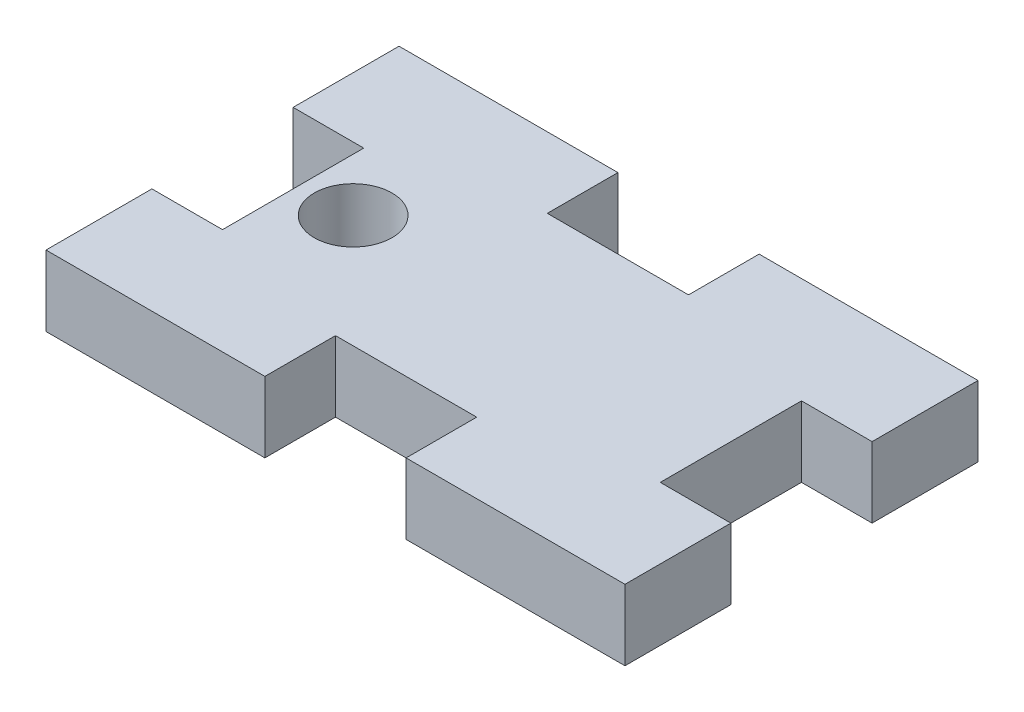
ISO-10303-21;
HEADER;
FILE_DESCRIPTION(('STEP AP214'),'2;1');
FILE_NAME('part.step','',(''),(''),'','','');
FILE_SCHEMA(('AUTOMOTIVE_DESIGN { 1 0 10303 214 1 1 1 1 }'));
ENDSEC;
DATA;
#1=APPLICATION_CONTEXT('core data for automotive mechanical design processes');
#2=APPLICATION_PROTOCOL_DEFINITION('international standard','automotive_design',2000,#1);
#3=PRODUCT_CONTEXT('',#1,'mechanical');
#4=PRODUCT('Part','Part','',(#3));
#5=PRODUCT_RELATED_PRODUCT_CATEGORY('part','',(#4));
#6=PRODUCT_DEFINITION_FORMATION('','',#4);
#7=PRODUCT_DEFINITION_CONTEXT('part definition',#1,'design');
#8=PRODUCT_DEFINITION('design','',#6,#7);
#9=PRODUCT_DEFINITION_SHAPE('','',#8);
#10=(LENGTH_UNIT() NAMED_UNIT(*) SI_UNIT(.MILLI.,.METRE.));
#11=(NAMED_UNIT(*) PLANE_ANGLE_UNIT() SI_UNIT($,.RADIAN.));
#12=(NAMED_UNIT(*) SI_UNIT($,.STERADIAN.) SOLID_ANGLE_UNIT());
#13=UNCERTAINTY_MEASURE_WITH_UNIT(LENGTH_MEASURE(1.E-05),#10,'distance_accuracy_value','');
#14=(GEOMETRIC_REPRESENTATION_CONTEXT(3) GLOBAL_UNCERTAINTY_ASSIGNED_CONTEXT((#13)) GLOBAL_UNIT_ASSIGNED_CONTEXT((#10,
#11,#12)) REPRESENTATION_CONTEXT('',''));
#15=CARTESIAN_POINT('',(0.,0.,0.));
#16=DIRECTION('',(0.,0.,1.));
#17=DIRECTION('',(1.,0.,0.));
#18=AXIS2_PLACEMENT_3D('',#15,#16,#17);
#19=CARTESIAN_POINT('',(0.,5.,0.));
#20=DIRECTION('',(0.,1.,0.));
#21=DIRECTION('',(0.,0.,1.));
#22=AXIS2_PLACEMENT_3D('',#19,#20,#21);
#23=PLANE('',#22);
#24=CARTESIAN_POINT('',(-11.75,5.,-0.499999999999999));
#25=DIRECTION('',(0.,1.,0.));
#26=DIRECTION('',(0.,0.,1.));
#27=AXIS2_PLACEMENT_3D('',#24,#25,#26);
#28=CIRCLE('',#27,2.75);
#29=CARTESIAN_POINT('',(-11.75,5.,2.25));
#30=VERTEX_POINT('',#29);
#31=EDGE_CURVE('E371',#30,#30,#28,.T.);
#32=ORIENTED_EDGE('',*,*,#31,.F.);
#33=EDGE_LOOP('',(#32));
#34=FACE_BOUND('',#33,.T.);
#35=DIRECTION('',(0.,0.,-1.));
#36=VECTOR('',#35,1.);
#37=CARTESIAN_POINT('',(20.5,5.,-12.5));
#38=LINE('',#37,#36);
#39=CARTESIAN_POINT('',(20.5,5.,12.5));
#40=VERTEX_POINT('',#39);
#41=CARTESIAN_POINT('',(20.5,5.,5.));
#42=VERTEX_POINT('',#41);
#43=EDGE_CURVE('E308',#40,#42,#38,.T.);
#44=ORIENTED_EDGE('',*,*,#43,.T.);
#45=DIRECTION('',(-1.,0.,0.));
#46=VECTOR('',#45,1.);
#47=CARTESIAN_POINT('',(20.5,5.,5.));
#48=LINE('',#47,#46);
#49=CARTESIAN_POINT('',(15.5,5.,5.));
#50=VERTEX_POINT('',#49);
#51=EDGE_CURVE('E176',#42,#50,#48,.T.);
#52=ORIENTED_EDGE('',*,*,#51,.T.);
#53=DIRECTION('',(0.,0.,-1.));
#54=VECTOR('',#53,1.);
#55=CARTESIAN_POINT('',(15.5,5.,-5.));
#56=LINE('',#55,#54);
#57=CARTESIAN_POINT('',(15.5,5.,-5.));
#58=VERTEX_POINT('',#57);
#59=EDGE_CURVE('E348',#50,#58,#56,.T.);
#60=ORIENTED_EDGE('',*,*,#59,.T.);
#61=DIRECTION('',(1.,0.,0.));
#62=VECTOR('',#61,1.);
#63=CARTESIAN_POINT('',(20.5,5.,-5.));
#64=LINE('',#63,#62);
#65=CARTESIAN_POINT('',(20.5,5.,-5.));
#66=VERTEX_POINT('',#65);
#67=EDGE_CURVE('E190',#58,#66,#64,.T.);
#68=ORIENTED_EDGE('',*,*,#67,.T.);
#69=CARTESIAN_POINT('',(20.5,5.,-12.5));
#70=VERTEX_POINT('',#69);
#71=EDGE_CURVE('E214',#66,#70,#38,.T.);
#72=ORIENTED_EDGE('',*,*,#71,.T.);
#73=DIRECTION('',(-1.,0.,0.));
#74=VECTOR('',#73,1.);
#75=CARTESIAN_POINT('',(-20.5,5.,-12.5));
#76=LINE('',#75,#74);
#77=CARTESIAN_POINT('',(5.,5.,-12.5));
#78=VERTEX_POINT('',#77);
#79=EDGE_CURVE('E311',#70,#78,#76,.T.);
#80=ORIENTED_EDGE('',*,*,#79,.T.);
#81=DIRECTION('',(0.,0.,1.));
#82=VECTOR('',#81,1.);
#83=CARTESIAN_POINT('',(5.,5.,-12.5));
#84=LINE('',#83,#82);
#85=CARTESIAN_POINT('',(5.,5.,-7.5));
#86=VERTEX_POINT('',#85);
#87=EDGE_CURVE('E272',#78,#86,#84,.T.);
#88=ORIENTED_EDGE('',*,*,#87,.T.);
#89=DIRECTION('',(-1.,0.,0.));
#90=VECTOR('',#89,1.);
#91=CARTESIAN_POINT('',(-5.,5.,-7.5));
#92=LINE('',#91,#90);
#93=CARTESIAN_POINT('',(-5.,5.,-7.5));
#94=VERTEX_POINT('',#93);
#95=EDGE_CURVE('E269',#86,#94,#92,.T.);
#96=ORIENTED_EDGE('',*,*,#95,.T.);
#97=DIRECTION('',(0.,0.,-1.));
#98=VECTOR('',#97,1.);
#99=CARTESIAN_POINT('',(-5.,5.,-12.5));
#100=LINE('',#99,#98);
#101=CARTESIAN_POINT('',(-5.,5.,-12.5));
#102=VERTEX_POINT('',#101);
#103=EDGE_CURVE('E259',#94,#102,#100,.T.);
#104=ORIENTED_EDGE('',*,*,#103,.T.);
#105=CARTESIAN_POINT('',(-20.5,5.,-12.5));
#106=VERTEX_POINT('',#105);
#107=EDGE_CURVE('E310',#102,#106,#76,.T.);
#108=ORIENTED_EDGE('',*,*,#107,.T.);
#109=DIRECTION('',(0.,0.,1.));
#110=VECTOR('',#109,1.);
#111=CARTESIAN_POINT('',(-20.5,5.,-12.5));
#112=LINE('',#111,#110);
#113=CARTESIAN_POINT('',(-20.5,5.,-5.));
#114=VERTEX_POINT('',#113);
#115=EDGE_CURVE('E226',#106,#114,#112,.T.);
#116=ORIENTED_EDGE('',*,*,#115,.T.);
#117=DIRECTION('',(-1.,0.,0.));
#118=VECTOR('',#117,1.);
#119=CARTESIAN_POINT('',(-20.5,5.,-5.));
#120=LINE('',#119,#118);
#121=CARTESIAN_POINT('',(-15.5,5.,-5.));
#122=VERTEX_POINT('',#121);
#123=EDGE_CURVE('E248',#122,#114,#120,.T.);
#124=ORIENTED_EDGE('',*,*,#123,.F.);
#125=DIRECTION('',(0.,0.,-1.));
#126=VECTOR('',#125,1.);
#127=CARTESIAN_POINT('',(-15.5,5.,-5.));
#128=LINE('',#127,#126);
#129=CARTESIAN_POINT('',(-15.5,5.,5.));
#130=VERTEX_POINT('',#129);
#131=EDGE_CURVE('E241',#130,#122,#128,.T.);
#132=ORIENTED_EDGE('',*,*,#131,.F.);
#133=DIRECTION('',(1.,0.,0.));
#134=VECTOR('',#133,1.);
#135=CARTESIAN_POINT('',(-20.5,5.,5.));
#136=LINE('',#135,#134);
#137=CARTESIAN_POINT('',(-20.5,5.,5.));
#138=VERTEX_POINT('',#137);
#139=EDGE_CURVE('E238',#138,#130,#136,.T.);
#140=ORIENTED_EDGE('',*,*,#139,.F.);
#141=CARTESIAN_POINT('',(-20.5,5.,12.5));
#142=VERTEX_POINT('',#141);
#143=EDGE_CURVE('E313',#138,#142,#112,.T.);
#144=ORIENTED_EDGE('',*,*,#143,.T.);
#145=DIRECTION('',(1.,0.,0.));
#146=VECTOR('',#145,1.);
#147=CARTESIAN_POINT('',(-20.5,5.,12.5));
#148=LINE('',#147,#146);
#149=CARTESIAN_POINT('',(-5.,5.,12.5));
#150=VERTEX_POINT('',#149);
#151=EDGE_CURVE('E202',#142,#150,#148,.T.);
#152=ORIENTED_EDGE('',*,*,#151,.T.);
#153=DIRECTION('',(0.,0.,1.));
#154=VECTOR('',#153,1.);
#155=CARTESIAN_POINT('',(-5.,5.,12.5));
#156=LINE('',#155,#154);
#157=CARTESIAN_POINT('',(-5.,5.,7.5));
#158=VERTEX_POINT('',#157);
#159=EDGE_CURVE('E266',#158,#150,#156,.T.);
#160=ORIENTED_EDGE('',*,*,#159,.F.);
#161=DIRECTION('',(-1.,0.,0.));
#162=VECTOR('',#161,1.);
#163=CARTESIAN_POINT('',(-5.,5.,7.5));
#164=LINE('',#163,#162);
#165=CARTESIAN_POINT('',(5.,5.,7.5));
#166=VERTEX_POINT('',#165);
#167=EDGE_CURVE('E297',#166,#158,#164,.T.);
#168=ORIENTED_EDGE('',*,*,#167,.F.);
#169=DIRECTION('',(0.,0.,-1.));
#170=VECTOR('',#169,1.);
#171=CARTESIAN_POINT('',(5.,5.,12.5));
#172=LINE('',#171,#170);
#173=CARTESIAN_POINT('',(5.,5.,12.5));
#174=VERTEX_POINT('',#173);
#175=EDGE_CURVE('E294',#174,#166,#172,.T.);
#176=ORIENTED_EDGE('',*,*,#175,.F.);
#177=EDGE_CURVE('E314',#174,#40,#148,.T.);
#178=ORIENTED_EDGE('',*,*,#177,.T.);
#179=EDGE_LOOP('',(#44,#52,#60,#68,#72,#80,#88,#96,#104,#108,#116,#124,#132,#140,#144,#152,#160,
#168,#176,#178));
#180=FACE_BOUND('',#179,.T.);
#181=ADVANCED_FACE('F33',(#34,#180),#23,.T.);
#182=CARTESIAN_POINT('',(0.,0.,0.));
#183=DIRECTION('',(0.,1.,0.));
#184=DIRECTION('',(0.,0.,1.));
#185=AXIS2_PLACEMENT_3D('',#182,#183,#184);
#186=PLANE('',#185);
#187=CARTESIAN_POINT('',(-11.75,0.,-0.499999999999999));
#188=DIRECTION('',(0.,1.,0.));
#189=DIRECTION('',(0.,0.,1.));
#190=AXIS2_PLACEMENT_3D('',#187,#188,#189);
#191=CIRCLE('',#190,2.75);
#192=CARTESIAN_POINT('',(-11.75,0.,2.25));
#193=VERTEX_POINT('',#192);
#194=EDGE_CURVE('E368',#193,#193,#191,.F.);
#195=ORIENTED_EDGE('',*,*,#194,.F.);
#196=EDGE_LOOP('',(#195));
#197=FACE_BOUND('',#196,.T.);
#198=DIRECTION('',(1.,0.,0.));
#199=VECTOR('',#198,1.);
#200=CARTESIAN_POINT('',(20.5,0.,5.));
#201=LINE('',#200,#199);
#202=CARTESIAN_POINT('',(15.5,0.,5.));
#203=VERTEX_POINT('',#202);
#204=CARTESIAN_POINT('',(20.5,0.,5.));
#205=VERTEX_POINT('',#204);
#206=EDGE_CURVE('E173',#203,#205,#201,.T.);
#207=ORIENTED_EDGE('',*,*,#206,.T.);
#208=DIRECTION('',(0.,0.,-1.));
#209=VECTOR('',#208,1.);
#210=CARTESIAN_POINT('',(20.5,0.,-12.5));
#211=LINE('',#210,#209);
#212=CARTESIAN_POINT('',(20.5,0.,12.5));
#213=VERTEX_POINT('',#212);
#214=EDGE_CURVE('E188',#213,#205,#211,.T.);
#215=ORIENTED_EDGE('',*,*,#214,.F.);
#216=DIRECTION('',(1.,0.,0.));
#217=VECTOR('',#216,1.);
#218=CARTESIAN_POINT('',(-20.5,0.,12.5));
#219=LINE('',#218,#217);
#220=CARTESIAN_POINT('',(5.,0.,12.5));
#221=VERTEX_POINT('',#220);
#222=EDGE_CURVE('E210',#221,#213,#219,.T.);
#223=ORIENTED_EDGE('',*,*,#222,.F.);
#224=DIRECTION('',(0.,0.,1.));
#225=VECTOR('',#224,1.);
#226=CARTESIAN_POINT('',(5.,0.,12.5));
#227=LINE('',#226,#225);
#228=CARTESIAN_POINT('',(5.,0.,7.5));
#229=VERTEX_POINT('',#228);
#230=EDGE_CURVE('E286',#229,#221,#227,.T.);
#231=ORIENTED_EDGE('',*,*,#230,.F.);
#232=DIRECTION('',(1.,0.,0.));
#233=VECTOR('',#232,1.);
#234=CARTESIAN_POINT('',(-5.,0.,7.5));
#235=LINE('',#234,#233);
#236=CARTESIAN_POINT('',(-5.,0.,7.5));
#237=VERTEX_POINT('',#236);
#238=EDGE_CURVE('E288',#237,#229,#235,.T.);
#239=ORIENTED_EDGE('',*,*,#238,.F.);
#240=DIRECTION('',(0.,0.,-1.));
#241=VECTOR('',#240,1.);
#242=CARTESIAN_POINT('',(-5.,0.,12.5));
#243=LINE('',#242,#241);
#244=CARTESIAN_POINT('',(-5.,0.,12.5));
#245=VERTEX_POINT('',#244);
#246=EDGE_CURVE('E200',#245,#237,#243,.T.);
#247=ORIENTED_EDGE('',*,*,#246,.F.);
#248=CARTESIAN_POINT('',(-20.5,0.,12.5));
#249=VERTEX_POINT('',#248);
#250=EDGE_CURVE('E211',#249,#245,#219,.T.);
#251=ORIENTED_EDGE('',*,*,#250,.F.);
#252=DIRECTION('',(0.,0.,1.));
#253=VECTOR('',#252,1.);
#254=CARTESIAN_POINT('',(-20.5,0.,-12.5));
#255=LINE('',#254,#253);
#256=CARTESIAN_POINT('',(-20.5,0.,5.));
#257=VERTEX_POINT('',#256);
#258=EDGE_CURVE('E206',#257,#249,#255,.T.);
#259=ORIENTED_EDGE('',*,*,#258,.F.);
#260=DIRECTION('',(-1.,0.,0.));
#261=VECTOR('',#260,1.);
#262=CARTESIAN_POINT('',(-20.5,0.,5.));
#263=LINE('',#262,#261);
#264=CARTESIAN_POINT('',(-15.5,0.,5.));
#265=VERTEX_POINT('',#264);
#266=EDGE_CURVE('E56',#265,#257,#263,.T.);
#267=ORIENTED_EDGE('',*,*,#266,.F.);
#268=DIRECTION('',(0.,0.,1.));
#269=VECTOR('',#268,1.);
#270=CARTESIAN_POINT('',(-15.5,0.,-5.));
#271=LINE('',#270,#269);
#272=CARTESIAN_POINT('',(-15.5,0.,-5.));
#273=VERTEX_POINT('',#272);
#274=EDGE_CURVE('E236',#273,#265,#271,.T.);
#275=ORIENTED_EDGE('',*,*,#274,.F.);
#276=DIRECTION('',(1.,0.,0.));
#277=VECTOR('',#276,1.);
#278=CARTESIAN_POINT('',(-20.5,0.,-5.));
#279=LINE('',#278,#277);
#280=CARTESIAN_POINT('',(-20.5,0.,-5.));
#281=VERTEX_POINT('',#280);
#282=EDGE_CURVE('E234',#281,#273,#279,.T.);
#283=ORIENTED_EDGE('',*,*,#282,.F.);
#284=CARTESIAN_POINT('',(-20.5,0.,-12.5));
#285=VERTEX_POINT('',#284);
#286=EDGE_CURVE('E207',#285,#281,#255,.T.);
#287=ORIENTED_EDGE('',*,*,#286,.F.);
#288=DIRECTION('',(-1.,0.,0.));
#289=VECTOR('',#288,1.);
#290=CARTESIAN_POINT('',(-20.5,0.,-12.5));
#291=LINE('',#290,#289);
#292=CARTESIAN_POINT('',(-5.,0.,-12.5));
#293=VERTEX_POINT('',#292);
#294=EDGE_CURVE('E195',#293,#285,#291,.T.);
#295=ORIENTED_EDGE('',*,*,#294,.F.);
#296=DIRECTION('',(0.,0.,1.));
#297=VECTOR('',#296,1.);
#298=CARTESIAN_POINT('',(-5.,0.,-12.5));
#299=LINE('',#298,#297);
#300=CARTESIAN_POINT('',(-5.,0.,-7.5));
#301=VERTEX_POINT('',#300);
#302=EDGE_CURVE('E263',#293,#301,#299,.T.);
#303=ORIENTED_EDGE('',*,*,#302,.T.);
#304=DIRECTION('',(1.,0.,0.));
#305=VECTOR('',#304,1.);
#306=CARTESIAN_POINT('',(-5.,0.,-7.5));
#307=LINE('',#306,#305);
#308=CARTESIAN_POINT('',(5.,0.,-7.5));
#309=VERTEX_POINT('',#308);
#310=EDGE_CURVE('E264',#301,#309,#307,.T.);
#311=ORIENTED_EDGE('',*,*,#310,.T.);
#312=DIRECTION('',(0.,0.,-1.));
#313=VECTOR('',#312,1.);
#314=CARTESIAN_POINT('',(5.,0.,-12.5));
#315=LINE('',#314,#313);
#316=CARTESIAN_POINT('',(5.,0.,-12.5));
#317=VERTEX_POINT('',#316);
#318=EDGE_CURVE('E260',#309,#317,#315,.T.);
#319=ORIENTED_EDGE('',*,*,#318,.T.);
#320=CARTESIAN_POINT('',(20.5,0.,-12.5));
#321=VERTEX_POINT('',#320);
#322=EDGE_CURVE('E198',#321,#317,#291,.T.);
#323=ORIENTED_EDGE('',*,*,#322,.F.);
#324=CARTESIAN_POINT('',(20.5,0.,-5.));
#325=VERTEX_POINT('',#324);
#326=EDGE_CURVE('E196',#325,#321,#211,.T.);
#327=ORIENTED_EDGE('',*,*,#326,.F.);
#328=DIRECTION('',(-1.,0.,0.));
#329=VECTOR('',#328,1.);
#330=CARTESIAN_POINT('',(20.5,0.,-5.));
#331=LINE('',#330,#329);
#332=CARTESIAN_POINT('',(15.5,0.,-5.));
#333=VERTEX_POINT('',#332);
#334=EDGE_CURVE('E48',#325,#333,#331,.T.);
#335=ORIENTED_EDGE('',*,*,#334,.T.);
#336=DIRECTION('',(0.,0.,1.));
#337=VECTOR('',#336,1.);
#338=CARTESIAN_POINT('',(15.5,0.,-5.));
#339=LINE('',#338,#337);
#340=EDGE_CURVE('E189',#333,#203,#339,.T.);
#341=ORIENTED_EDGE('',*,*,#340,.T.);
#342=EDGE_LOOP('',(#207,#215,#223,#231,#239,#247,#251,#259,#267,#275,#283,#287,#295,#303,#311,
#319,#323,#327,#335,#341));
#343=FACE_BOUND('',#342,.T.);
#344=ADVANCED_FACE('F186',(#197,#343),#186,.F.);
#345=CARTESIAN_POINT('',(20.5,5.,-12.5));
#346=DIRECTION('',(-1.,0.,0.));
#347=DIRECTION('',(0.,0.,1.));
#348=AXIS2_PLACEMENT_3D('',#345,#346,#347);
#349=PLANE('',#348);
#350=DIRECTION('',(0.,1.,0.));
#351=VECTOR('',#350,1.);
#352=CARTESIAN_POINT('',(20.5,-0.00100000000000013,5.));
#353=LINE('',#352,#351);
#354=EDGE_CURVE('E170',#205,#42,#353,.T.);
#355=ORIENTED_EDGE('',*,*,#354,.T.);
#356=ORIENTED_EDGE('',*,*,#43,.F.);
#357=DIRECTION('',(0.,-1.,0.));
#358=VECTOR('',#357,1.);
#359=CARTESIAN_POINT('',(20.5,5.,12.5));
#360=LINE('',#359,#358);
#361=EDGE_CURVE('E194',#40,#213,#360,.T.);
#362=ORIENTED_EDGE('',*,*,#361,.T.);
#363=ORIENTED_EDGE('',*,*,#214,.T.);
#364=EDGE_LOOP('',(#355,#356,#362,#363));
#365=FACE_BOUND('',#364,.T.);
#366=ADVANCED_FACE('F35',(#365),#349,.F.);
#367=DIRECTION('',(0.,1.,0.));
#368=VECTOR('',#367,1.);
#369=CARTESIAN_POINT('',(20.5,-0.00100000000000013,-5.));
#370=LINE('',#369,#368);
#371=EDGE_CURVE('E349',#325,#66,#370,.T.);
#372=ORIENTED_EDGE('',*,*,#371,.F.);
#373=ORIENTED_EDGE('',*,*,#326,.T.);
#374=DIRECTION('',(0.,-1.,0.));
#375=VECTOR('',#374,1.);
#376=CARTESIAN_POINT('',(20.5,5.,-12.5));
#377=LINE('',#376,#375);
#378=EDGE_CURVE('E11',#70,#321,#377,.T.);
#379=ORIENTED_EDGE('',*,*,#378,.F.);
#380=ORIENTED_EDGE('',*,*,#71,.F.);
#381=EDGE_LOOP('',(#372,#373,#379,#380));
#382=FACE_BOUND('',#381,.T.);
#383=ADVANCED_FACE('F361',(#382),#349,.F.);
#384=CARTESIAN_POINT('',(-20.5,5.,-12.5));
#385=DIRECTION('',(1.,0.,0.));
#386=DIRECTION('',(0.,0.,-1.));
#387=AXIS2_PLACEMENT_3D('',#384,#385,#386);
#388=PLANE('',#387);
#389=ORIENTED_EDGE('',*,*,#286,.T.);
#390=DIRECTION('',(0.,1.,0.));
#391=VECTOR('',#390,1.);
#392=CARTESIAN_POINT('',(-20.5,-0.00100000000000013,-5.));
#393=LINE('',#392,#391);
#394=EDGE_CURVE('E251',#281,#114,#393,.T.);
#395=ORIENTED_EDGE('',*,*,#394,.T.);
#396=ORIENTED_EDGE('',*,*,#115,.F.);
#397=DIRECTION('',(0.,-1.,0.));
#398=VECTOR('',#397,1.);
#399=CARTESIAN_POINT('',(-20.5,5.,-12.5));
#400=LINE('',#399,#398);
#401=EDGE_CURVE('E41',#106,#285,#400,.T.);
#402=ORIENTED_EDGE('',*,*,#401,.T.);
#403=EDGE_LOOP('',(#389,#395,#396,#402));
#404=FACE_BOUND('',#403,.T.);
#405=ADVANCED_FACE('F223',(#404),#388,.F.);
#406=CARTESIAN_POINT('',(-20.5,5.,-12.5));
#407=DIRECTION('',(0.,0.,1.));
#408=DIRECTION('',(1.,0.,0.));
#409=AXIS2_PLACEMENT_3D('',#406,#407,#408);
#410=PLANE('',#409);
#411=DIRECTION('',(0.,1.,0.));
#412=VECTOR('',#411,1.);
#413=CARTESIAN_POINT('',(5.,-11.1803398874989,-12.5));
#414=LINE('',#413,#412);
#415=EDGE_CURVE('E278',#317,#78,#414,.T.);
#416=ORIENTED_EDGE('',*,*,#415,.T.);
#417=ORIENTED_EDGE('',*,*,#79,.F.);
#418=ORIENTED_EDGE('',*,*,#378,.T.);
#419=ORIENTED_EDGE('',*,*,#322,.T.);
#420=EDGE_LOOP('',(#416,#417,#418,#419));
#421=FACE_BOUND('',#420,.T.);
#422=ADVANCED_FACE('F392',(#421),#410,.F.);
#423=DIRECTION('',(0.,1.,0.));
#424=VECTOR('',#423,1.);
#425=CARTESIAN_POINT('',(-5.,-11.1803398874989,-12.5));
#426=LINE('',#425,#424);
#427=EDGE_CURVE('E276',#293,#102,#426,.T.);
#428=ORIENTED_EDGE('',*,*,#427,.F.);
#429=ORIENTED_EDGE('',*,*,#294,.T.);
#430=ORIENTED_EDGE('',*,*,#401,.F.);
#431=ORIENTED_EDGE('',*,*,#107,.F.);
#432=EDGE_LOOP('',(#428,#429,#430,#431));
#433=FACE_BOUND('',#432,.T.);
#434=ADVANCED_FACE('F394',(#433),#410,.F.);
#435=CARTESIAN_POINT('',(-20.5,5.,12.5));
#436=DIRECTION('',(0.,0.,-1.));
#437=DIRECTION('',(-1.,0.,0.));
#438=AXIS2_PLACEMENT_3D('',#435,#436,#437);
#439=PLANE('',#438);
#440=ORIENTED_EDGE('',*,*,#250,.T.);
#441=DIRECTION('',(0.,1.,0.));
#442=VECTOR('',#441,1.);
#443=CARTESIAN_POINT('',(-5.,-11.1803398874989,12.5));
#444=LINE('',#443,#442);
#445=EDGE_CURVE('E300',#245,#150,#444,.T.);
#446=ORIENTED_EDGE('',*,*,#445,.T.);
#447=ORIENTED_EDGE('',*,*,#151,.F.);
#448=DIRECTION('',(0.,-1.,0.));
#449=VECTOR('',#448,1.);
#450=CARTESIAN_POINT('',(-20.5,5.,12.5));
#451=LINE('',#450,#449);
#452=EDGE_CURVE('E216',#142,#249,#451,.T.);
#453=ORIENTED_EDGE('',*,*,#452,.T.);
#454=EDGE_LOOP('',(#440,#446,#447,#453));
#455=FACE_BOUND('',#454,.T.);
#456=ADVANCED_FACE('F329',(#455),#439,.F.);
#457=ORIENTED_EDGE('',*,*,#143,.F.);
#458=DIRECTION('',(0.,1.,0.));
#459=VECTOR('',#458,1.);
#460=CARTESIAN_POINT('',(-20.5,-0.00100000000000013,5.));
#461=LINE('',#460,#459);
#462=EDGE_CURVE('E250',#257,#138,#461,.T.);
#463=ORIENTED_EDGE('',*,*,#462,.F.);
#464=ORIENTED_EDGE('',*,*,#258,.T.);
#465=ORIENTED_EDGE('',*,*,#452,.F.);
#466=EDGE_LOOP('',(#457,#463,#464,#465));
#467=FACE_BOUND('',#466,.T.);
#468=ADVANCED_FACE('F325',(#467),#388,.F.);
#469=ORIENTED_EDGE('',*,*,#177,.F.);
#470=DIRECTION('',(0.,1.,0.));
#471=VECTOR('',#470,1.);
#472=CARTESIAN_POINT('',(5.,-11.1803398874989,12.5));
#473=LINE('',#472,#471);
#474=EDGE_CURVE('E304',#221,#174,#473,.T.);
#475=ORIENTED_EDGE('',*,*,#474,.F.);
#476=ORIENTED_EDGE('',*,*,#222,.T.);
#477=ORIENTED_EDGE('',*,*,#361,.F.);
#478=EDGE_LOOP('',(#469,#475,#476,#477));
#479=FACE_BOUND('',#478,.T.);
#480=ADVANCED_FACE('F344',(#479),#439,.F.);
#481=CARTESIAN_POINT('',(-5.,-11.1803398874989,12.5));
#482=DIRECTION('',(-1.,0.,0.));
#483=DIRECTION('',(0.,0.,1.));
#484=AXIS2_PLACEMENT_3D('',#481,#482,#483);
#485=PLANE('',#484);
#486=ORIENTED_EDGE('',*,*,#246,.T.);
#487=DIRECTION('',(0.,1.,0.));
#488=VECTOR('',#487,1.);
#489=CARTESIAN_POINT('',(-5.,-11.1803398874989,7.5));
#490=LINE('',#489,#488);
#491=EDGE_CURVE('E289',#237,#158,#490,.T.);
#492=ORIENTED_EDGE('',*,*,#491,.T.);
#493=ORIENTED_EDGE('',*,*,#159,.T.);
#494=ORIENTED_EDGE('',*,*,#445,.F.);
#495=EDGE_LOOP('',(#486,#492,#493,#494));
#496=FACE_BOUND('',#495,.T.);
#497=ADVANCED_FACE('F332',(#496),#485,.F.);
#498=CARTESIAN_POINT('',(-5.,-11.1803398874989,7.5));
#499=DIRECTION('',(0.,0.,-1.));
#500=DIRECTION('',(-1.,0.,0.));
#501=AXIS2_PLACEMENT_3D('',#498,#499,#500);
#502=PLANE('',#501);
#503=ORIENTED_EDGE('',*,*,#238,.T.);
#504=DIRECTION('',(0.,1.,0.));
#505=VECTOR('',#504,1.);
#506=CARTESIAN_POINT('',(5.,-11.1803398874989,7.5));
#507=LINE('',#506,#505);
#508=EDGE_CURVE('E302',#229,#166,#507,.T.);
#509=ORIENTED_EDGE('',*,*,#508,.T.);
#510=ORIENTED_EDGE('',*,*,#167,.T.);
#511=ORIENTED_EDGE('',*,*,#491,.F.);
#512=EDGE_LOOP('',(#503,#509,#510,#511));
#513=FACE_BOUND('',#512,.T.);
#514=ADVANCED_FACE('F337',(#513),#502,.F.);
#515=CARTESIAN_POINT('',(5.,-11.1803398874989,12.5));
#516=DIRECTION('',(1.,0.,0.));
#517=DIRECTION('',(0.,0.,-1.));
#518=AXIS2_PLACEMENT_3D('',#515,#516,#517);
#519=PLANE('',#518);
#520=ORIENTED_EDGE('',*,*,#230,.T.);
#521=ORIENTED_EDGE('',*,*,#474,.T.);
#522=ORIENTED_EDGE('',*,*,#175,.T.);
#523=ORIENTED_EDGE('',*,*,#508,.F.);
#524=EDGE_LOOP('',(#520,#521,#522,#523));
#525=FACE_BOUND('',#524,.T.);
#526=ADVANCED_FACE('F424',(#525),#519,.F.);
#527=CARTESIAN_POINT('',(-5.,-11.1803398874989,-7.5));
#528=DIRECTION('',(0.,0.,-1.));
#529=DIRECTION('',(-1.,0.,0.));
#530=AXIS2_PLACEMENT_3D('',#527,#528,#529);
#531=PLANE('',#530);
#532=DIRECTION('',(0.,1.,0.));
#533=VECTOR('',#532,1.);
#534=CARTESIAN_POINT('',(-5.,-11.1803398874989,-7.5));
#535=LINE('',#534,#533);
#536=EDGE_CURVE('E275',#301,#94,#535,.T.);
#537=ORIENTED_EDGE('',*,*,#536,.T.);
#538=ORIENTED_EDGE('',*,*,#95,.F.);
#539=DIRECTION('',(0.,1.,0.));
#540=VECTOR('',#539,1.);
#541=CARTESIAN_POINT('',(5.,-11.1803398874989,-7.5));
#542=LINE('',#541,#540);
#543=EDGE_CURVE('E281',#309,#86,#542,.T.);
#544=ORIENTED_EDGE('',*,*,#543,.F.);
#545=ORIENTED_EDGE('',*,*,#310,.F.);
#546=EDGE_LOOP('',(#537,#538,#544,#545));
#547=FACE_BOUND('',#546,.T.);
#548=ADVANCED_FACE('F406',(#547),#531,.T.);
#549=CARTESIAN_POINT('',(5.,-11.1803398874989,-12.5));
#550=DIRECTION('',(-1.,0.,0.));
#551=DIRECTION('',(0.,0.,1.));
#552=AXIS2_PLACEMENT_3D('',#549,#550,#551);
#553=PLANE('',#552);
#554=ORIENTED_EDGE('',*,*,#543,.T.);
#555=ORIENTED_EDGE('',*,*,#87,.F.);
#556=ORIENTED_EDGE('',*,*,#415,.F.);
#557=ORIENTED_EDGE('',*,*,#318,.F.);
#558=EDGE_LOOP('',(#554,#555,#556,#557));
#559=FACE_BOUND('',#558,.T.);
#560=ADVANCED_FACE('F402',(#559),#553,.T.);
#561=CARTESIAN_POINT('',(-5.,-11.1803398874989,-12.5));
#562=DIRECTION('',(1.,0.,0.));
#563=DIRECTION('',(0.,0.,-1.));
#564=AXIS2_PLACEMENT_3D('',#561,#562,#563);
#565=PLANE('',#564);
#566=ORIENTED_EDGE('',*,*,#427,.T.);
#567=ORIENTED_EDGE('',*,*,#103,.F.);
#568=ORIENTED_EDGE('',*,*,#536,.F.);
#569=ORIENTED_EDGE('',*,*,#302,.F.);
#570=EDGE_LOOP('',(#566,#567,#568,#569));
#571=FACE_BOUND('',#570,.T.);
#572=ADVANCED_FACE('F409',(#571),#565,.T.);
#573=CARTESIAN_POINT('',(-20.5,-0.00100000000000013,-5.));
#574=DIRECTION('',(0.,0.,-1.));
#575=DIRECTION('',(-1.,0.,0.));
#576=AXIS2_PLACEMENT_3D('',#573,#574,#575);
#577=PLANE('',#576);
#578=ORIENTED_EDGE('',*,*,#282,.T.);
#579=DIRECTION('',(0.,1.,0.));
#580=VECTOR('',#579,1.);
#581=CARTESIAN_POINT('',(-15.5,-0.00100000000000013,-5.));
#582=LINE('',#581,#580);
#583=EDGE_CURVE('E253',#273,#122,#582,.T.);
#584=ORIENTED_EDGE('',*,*,#583,.T.);
#585=ORIENTED_EDGE('',*,*,#123,.T.);
#586=ORIENTED_EDGE('',*,*,#394,.F.);
#587=EDGE_LOOP('',(#578,#584,#585,#586));
#588=FACE_BOUND('',#587,.T.);
#589=ADVANCED_FACE('F412',(#588),#577,.F.);
#590=CARTESIAN_POINT('',(-15.5,-0.00100000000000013,-5.));
#591=DIRECTION('',(1.,0.,0.));
#592=DIRECTION('',(0.,0.,-1.));
#593=AXIS2_PLACEMENT_3D('',#590,#591,#592);
#594=PLANE('',#593);
#595=ORIENTED_EDGE('',*,*,#274,.T.);
#596=DIRECTION('',(0.,1.,0.));
#597=VECTOR('',#596,1.);
#598=CARTESIAN_POINT('',(-15.5,-0.00100000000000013,5.));
#599=LINE('',#598,#597);
#600=EDGE_CURVE('E255',#265,#130,#599,.T.);
#601=ORIENTED_EDGE('',*,*,#600,.T.);
#602=ORIENTED_EDGE('',*,*,#131,.T.);
#603=ORIENTED_EDGE('',*,*,#583,.F.);
#604=EDGE_LOOP('',(#595,#601,#602,#603));
#605=FACE_BOUND('',#604,.T.);
#606=ADVANCED_FACE('F418',(#605),#594,.F.);
#607=CARTESIAN_POINT('',(-20.5,-0.00100000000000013,5.));
#608=DIRECTION('',(0.,0.,1.));
#609=DIRECTION('',(1.,0.,0.));
#610=AXIS2_PLACEMENT_3D('',#607,#608,#609);
#611=PLANE('',#610);
#612=ORIENTED_EDGE('',*,*,#266,.T.);
#613=ORIENTED_EDGE('',*,*,#462,.T.);
#614=ORIENTED_EDGE('',*,*,#139,.T.);
#615=ORIENTED_EDGE('',*,*,#600,.F.);
#616=EDGE_LOOP('',(#612,#613,#614,#615));
#617=FACE_BOUND('',#616,.T.);
#618=ADVANCED_FACE('F470',(#617),#611,.F.);
#619=CARTESIAN_POINT('',(20.5,-0.00100000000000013,5.));
#620=DIRECTION('',(0.,0.,-1.));
#621=DIRECTION('',(-1.,0.,0.));
#622=AXIS2_PLACEMENT_3D('',#619,#620,#621);
#623=PLANE('',#622);
#624=DIRECTION('',(0.,1.,0.));
#625=VECTOR('',#624,1.);
#626=CARTESIAN_POINT('',(15.5,-0.00100000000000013,5.));
#627=LINE('',#626,#625);
#628=EDGE_CURVE('E181',#203,#50,#627,.T.);
#629=ORIENTED_EDGE('',*,*,#628,.T.);
#630=ORIENTED_EDGE('',*,*,#51,.F.);
#631=ORIENTED_EDGE('',*,*,#354,.F.);
#632=ORIENTED_EDGE('',*,*,#206,.F.);
#633=EDGE_LOOP('',(#629,#630,#631,#632));
#634=FACE_BOUND('',#633,.T.);
#635=ADVANCED_FACE('F172',(#634),#623,.T.);
#636=CARTESIAN_POINT('',(15.5,-0.00100000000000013,-5.));
#637=DIRECTION('',(1.,0.,0.));
#638=DIRECTION('',(0.,0.,-1.));
#639=AXIS2_PLACEMENT_3D('',#636,#637,#638);
#640=PLANE('',#639);
#641=DIRECTION('',(0.,1.,0.));
#642=VECTOR('',#641,1.);
#643=CARTESIAN_POINT('',(15.5,-0.00100000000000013,-5.));
#644=LINE('',#643,#642);
#645=EDGE_CURVE('E351',#333,#58,#644,.T.);
#646=ORIENTED_EDGE('',*,*,#645,.T.);
#647=ORIENTED_EDGE('',*,*,#59,.F.);
#648=ORIENTED_EDGE('',*,*,#628,.F.);
#649=ORIENTED_EDGE('',*,*,#340,.F.);
#650=EDGE_LOOP('',(#646,#647,#648,#649));
#651=FACE_BOUND('',#650,.T.);
#652=ADVANCED_FACE('F503',(#651),#640,.T.);
#653=CARTESIAN_POINT('',(20.5,-0.00100000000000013,-5.));
#654=DIRECTION('',(0.,0.,1.));
#655=DIRECTION('',(1.,0.,0.));
#656=AXIS2_PLACEMENT_3D('',#653,#654,#655);
#657=PLANE('',#656);
#658=ORIENTED_EDGE('',*,*,#371,.T.);
#659=ORIENTED_EDGE('',*,*,#67,.F.);
#660=ORIENTED_EDGE('',*,*,#645,.F.);
#661=ORIENTED_EDGE('',*,*,#334,.F.);
#662=EDGE_LOOP('',(#658,#659,#660,#661));
#663=FACE_BOUND('',#662,.T.);
#664=ADVANCED_FACE('F364',(#663),#657,.T.);
#665=CARTESIAN_POINT('',(-11.75,-0.00100000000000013,-0.499999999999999));
#666=DIRECTION('',(0.,1.,0.));
#667=DIRECTION('',(0.,0.,1.));
#668=AXIS2_PLACEMENT_3D('',#665,#666,#667);
#669=CYLINDRICAL_SURFACE('',#668,2.75);
#670=ORIENTED_EDGE('',*,*,#31,.T.);
#671=EDGE_LOOP('',(#670));
#672=FACE_BOUND('',#671,.T.);
#673=ORIENTED_EDGE('',*,*,#194,.T.);
#674=EDGE_LOOP('',(#673));
#675=FACE_BOUND('',#674,.T.);
#676=ADVANCED_FACE('F375',(#672,#675),#669,.F.);
#677=CLOSED_SHELL('',(#181,#344,#366,#383,#405,#422,#434,#456,#468,#480,#497,#514,#526,#548,
#560,#572,#589,#606,#618,#635,#652,#664,#676));
#678=MANIFOLD_SOLID_BREP('B2',#677);
#679=ADVANCED_BREP_SHAPE_REPRESENTATION('',(#18,#678),#14);
#680=SHAPE_DEFINITION_REPRESENTATION(#9,#679);
ENDSEC;
END-ISO-10303-21;
